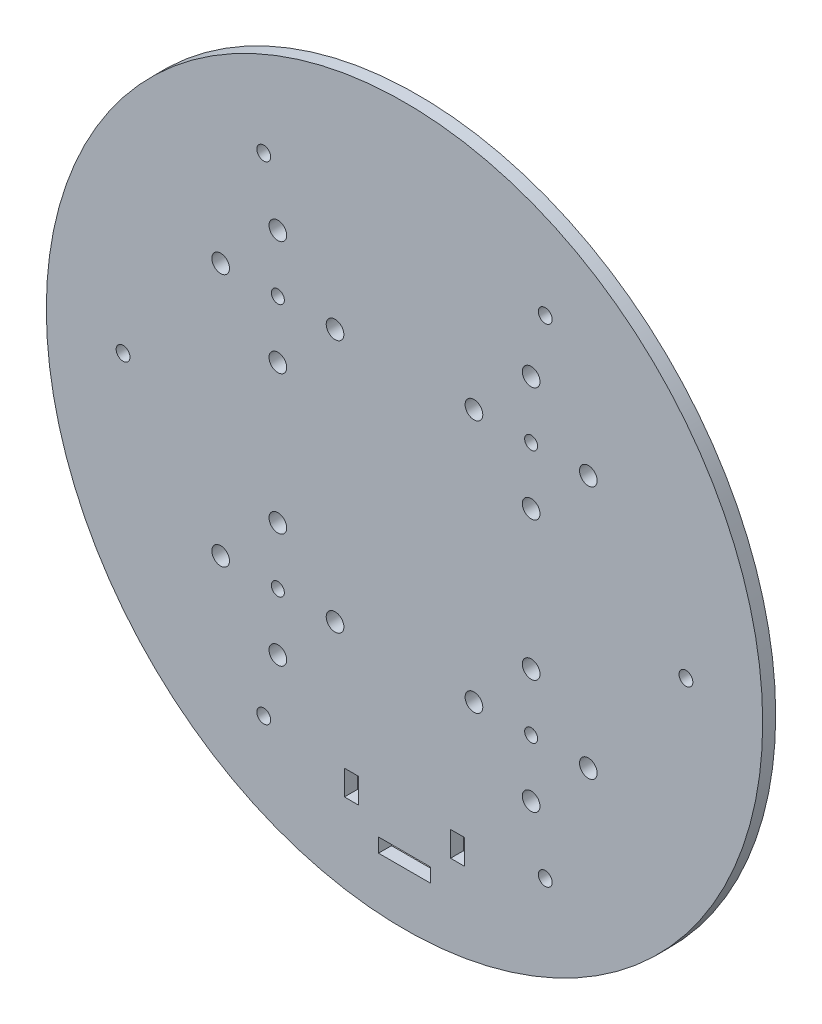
from build123d import *

# Parameters (mm, degrees)
SKETCH2_R           = 175
SKETCH2_R_2         = 3.375
BOSS_EXTRUDE2_DEPTH = 6.35
SKETCH3_W           = 6.858
SKETCH3_H           = 12.192
SKETCH3_W_2         = 25.4
SKETCH3_H_2         = 6.858014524
CUT_EXTRUDE1_DEPTH  = 10
SKETCH4_R           = 3.175
SKETCH4_R_2         = 4.318
CUT_EXTRUDE2_DEPTH  = 248.568823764


with BuildPart() as part:
    # Sketch2 → Boss-Extrude2 (new body)
    with BuildSketch(Plane(origin=(0, 0, 0), x_dir=(0, 1, 0), z_dir=(0, 0, 1))):
        with Locations(Location((0, 0, 0), (0, 0, 270))):
            Circle(SKETCH2_R)
        with Locations(Location((0, 137.5, 0), (0, 0, 270))):
            Circle(SKETCH2_R_2, mode=Mode.SUBTRACT)
        with Locations(Location((119.07849302, 68.75, 0), (0, 0, 270))):
            Circle(SKETCH2_R_2, mode=Mode.SUBTRACT)
        with Locations(Location((119.07849302, -68.75, 0), (0, 0, 270))):
            Circle(SKETCH2_R_2, mode=Mode.SUBTRACT)
        with Locations(Location((0, -137.5, 0), (0, 0, 270))):
            Circle(SKETCH2_R_2, mode=Mode.SUBTRACT)
        with Locations(Location((-119.07849302, -68.75, 0), (0, 0, 270))):
            Circle(SKETCH2_R_2, mode=Mode.SUBTRACT)
        with Locations(Location((-119.07849302, 68.75, 0), (0, 0, 270))):
            Circle(SKETCH2_R_2, mode=Mode.SUBTRACT)
    extrude(amount=BOSS_EXTRUDE2_DEPTH)

    # Sketch3 → Cut-Extrude1 (cut)
    with BuildSketch(Plane.XY.offset(6.35)):
        with Locations((-25.929, -127.554)):
            Rectangle(SKETCH3_W, SKETCH3_H)
        with Locations((-9.1823e-05, -145.679007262)):
            Rectangle(SKETCH3_W_2, SKETCH3_H_2)
        with Locations((25.929, -127.554)):
            Rectangle(SKETCH3_W, SKETCH3_H)
    extrude(amount=-CUT_EXTRUDE1_DEPTH, mode=Mode.SUBTRACT)

    # Sketch4 → Cut-Extrude2 (cut, through all)
    with BuildSketch(Plane.XY.offset(6.35)):
        with Locations((61.871843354, 61.871843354)):
            Circle(SKETCH4_R)
        with Locations((61.871843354, -61.871843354)):
            Circle(SKETCH4_R)
        with Locations((-61.871843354, -61.871843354)):
            Circle(SKETCH4_R)
        with Locations((-61.871843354, 61.871843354)):
            Circle(SKETCH4_R)
        with Locations((-61.871843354, 89.811843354)):
            Circle(SKETCH4_R_2)
        with Locations((-33.931843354, 61.871843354)):
            Circle(SKETCH4_R_2)
        with Locations((-61.871843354, 33.931843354)):
            Circle(SKETCH4_R_2)
        with Locations((-89.811843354, 61.871843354)):
            Circle(SKETCH4_R_2)
        with Locations((89.811843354, 61.871843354)):
            Circle(SKETCH4_R_2)
        with Locations((61.871843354, 33.931843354)):
            Circle(SKETCH4_R_2)
        with Locations((33.931843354, 61.871843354)):
            Circle(SKETCH4_R_2)
        with Locations((61.871843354, 89.811843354)):
            Circle(SKETCH4_R_2)
        with Locations((61.871843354, -89.811843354)):
            Circle(SKETCH4_R_2)
        with Locations((33.931843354, -61.871843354)):
            Circle(SKETCH4_R_2)
        with Locations((61.871843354, -33.931843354)):
            Circle(SKETCH4_R_2)
        with Locations((89.811843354, -61.871843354)):
            Circle(SKETCH4_R_2)
        with Locations((-89.811843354, -61.871843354)):
            Circle(SKETCH4_R_2)
        with Locations((-61.871843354, -33.931843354)):
            Circle(SKETCH4_R_2)
        with Locations((-33.931843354, -61.871843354)):
            Circle(SKETCH4_R_2)
        with Locations((-61.871843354, -89.811843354)):
            Circle(SKETCH4_R_2)
    extrude(amount=-CUT_EXTRUDE2_DEPTH, mode=Mode.SUBTRACT)


solid = part.part
